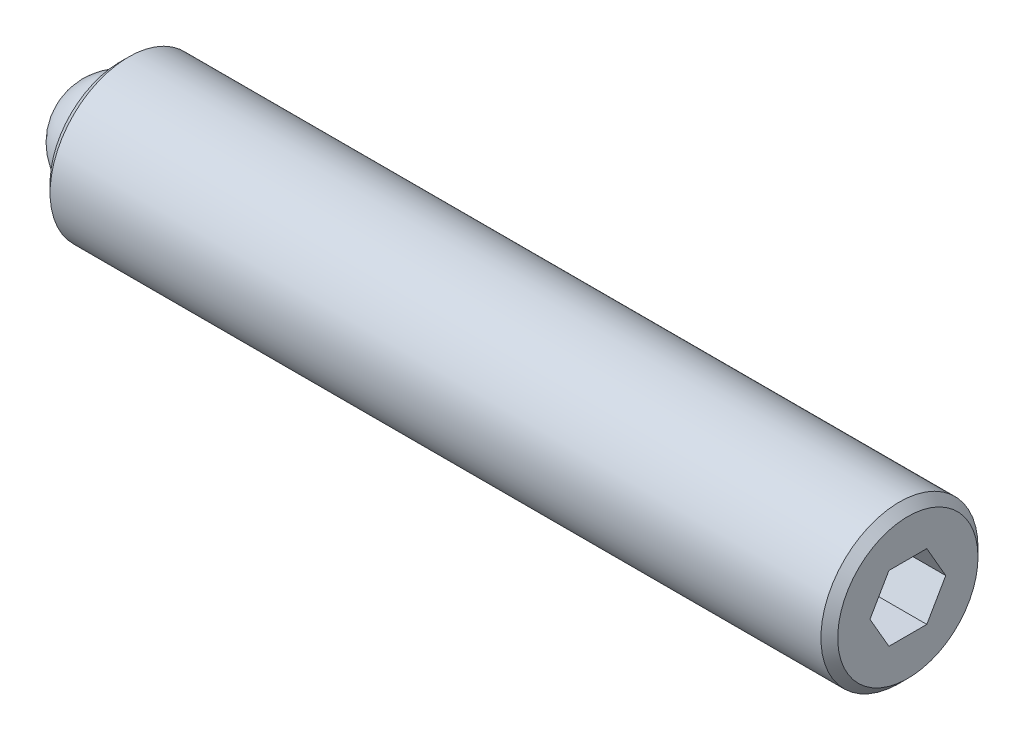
ISO-10303-21;
HEADER;
FILE_DESCRIPTION(('STEP AP214'),'2;1');
FILE_NAME('part.step','',(''),(''),'','','');
FILE_SCHEMA(('AUTOMOTIVE_DESIGN { 1 0 10303 214 1 1 1 1 }'));
ENDSEC;
DATA;
#1=APPLICATION_CONTEXT('core data for automotive mechanical design processes');
#2=APPLICATION_PROTOCOL_DEFINITION('international standard','automotive_design',2000,#1);
#3=PRODUCT_CONTEXT('',#1,'mechanical');
#4=PRODUCT('Part','Part','',(#3));
#5=PRODUCT_RELATED_PRODUCT_CATEGORY('part','',(#4));
#6=PRODUCT_DEFINITION_FORMATION('','',#4);
#7=PRODUCT_DEFINITION_CONTEXT('part definition',#1,'design');
#8=PRODUCT_DEFINITION('design','',#6,#7);
#9=PRODUCT_DEFINITION_SHAPE('','',#8);
#10=(LENGTH_UNIT() NAMED_UNIT(*) SI_UNIT(.MILLI.,.METRE.));
#11=(NAMED_UNIT(*) PLANE_ANGLE_UNIT() SI_UNIT($,.RADIAN.));
#12=(NAMED_UNIT(*) SI_UNIT($,.STERADIAN.) SOLID_ANGLE_UNIT());
#13=UNCERTAINTY_MEASURE_WITH_UNIT(LENGTH_MEASURE(1.E-05),#10,'distance_accuracy_value','');
#14=(GEOMETRIC_REPRESENTATION_CONTEXT(3) GLOBAL_UNCERTAINTY_ASSIGNED_CONTEXT((#13)) GLOBAL_UNIT_ASSIGNED_CONTEXT((#10,
#11,#12)) REPRESENTATION_CONTEXT('',''));
#15=CARTESIAN_POINT('',(0.,0.,0.));
#16=DIRECTION('',(0.,0.,1.));
#17=DIRECTION('',(1.,0.,0.));
#18=AXIS2_PLACEMENT_3D('',#15,#16,#17);
#19=CARTESIAN_POINT('',(0.,0.,0.));
#20=DIRECTION('',(0.,-1.,0.));
#21=DIRECTION('',(0.,0.,1.));
#22=AXIS2_PLACEMENT_3D('',#19,#20,#21);
#23=SPHERICAL_SURFACE('',#22,1.5875);
#24=CARTESIAN_POINT('',(0.,-1.5875,0.));
#25=VERTEX_POINT('',#24);
#26=VERTEX_LOOP('',#25);
#27=FACE_BOUND('',#26,.T.);
#28=ADVANCED_FACE('F43',(#27),#23,.T.);
#29=CLOSED_SHELL('',(#28));
#30=MANIFOLD_SOLID_BREP('B2',#29);
#31=CARTESIAN_POINT('',(23.8125,0.,0.));
#32=DIRECTION('',(-1.,0.,0.));
#33=DIRECTION('',(0.,0.,1.));
#34=AXIS2_PLACEMENT_3D('',#31,#32,#33);
#35=CYLINDRICAL_SURFACE('',#34,2.3749);
#36=CARTESIAN_POINT('',(23.5585,0.,0.));
#37=DIRECTION('',(1.,0.,0.));
#38=DIRECTION('',(0.,0.,-1.));
#39=AXIS2_PLACEMENT_3D('',#36,#37,#38);
#40=CIRCLE('',#39,2.3749);
#41=CARTESIAN_POINT('',(23.5585,0.,-2.3749));
#42=VERTEX_POINT('',#41);
#43=EDGE_CURVE('E41',#42,#42,#40,.F.);
#44=ORIENTED_EDGE('',*,*,#43,.T.);
#45=EDGE_LOOP('',(#44));
#46=FACE_BOUND('',#45,.T.);
#47=CARTESIAN_POINT('',(0.254000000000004,0.,0.));
#48=DIRECTION('',(1.,0.,0.));
#49=DIRECTION('',(0.,0.,-1.));
#50=AXIS2_PLACEMENT_3D('',#47,#48,#49);
#51=CIRCLE('',#50,2.3749);
#52=CARTESIAN_POINT('',(0.254000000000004,0.,-2.3749));
#53=VERTEX_POINT('',#52);
#54=EDGE_CURVE('E177',#53,#53,#51,.T.);
#55=ORIENTED_EDGE('',*,*,#54,.T.);
#56=EDGE_LOOP('',(#55));
#57=FACE_BOUND('',#56,.T.);
#58=ADVANCED_FACE('F56',(#46,#57),#35,.T.);
#59=CARTESIAN_POINT('',(23.8125,0.,0.));
#60=DIRECTION('',(1.,0.,0.));
#61=DIRECTION('',(0.,0.,-1.));
#62=AXIS2_PLACEMENT_3D('',#59,#60,#61);
#63=PLANE('',#62);
#64=DIRECTION('',(0.,0.866025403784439,-0.5));
#65=VECTOR('',#64,1.);
#66=CARTESIAN_POINT('',(23.8125,-0.992187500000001,-0.572839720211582));
#67=LINE('',#66,#65);
#68=CARTESIAN_POINT('',(23.8125,-0.992187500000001,-0.572839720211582));
#69=VERTEX_POINT('',#68);
#70=CARTESIAN_POINT('',(23.8125,0.,-1.14567944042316));
#71=VERTEX_POINT('',#70);
#72=EDGE_CURVE('E78',#69,#71,#67,.T.);
#73=ORIENTED_EDGE('',*,*,#72,.F.);
#74=DIRECTION('',(0.,0.,-1.));
#75=VECTOR('',#74,1.);
#76=CARTESIAN_POINT('',(23.8125,-0.992187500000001,0.572839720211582));
#77=LINE('',#76,#75);
#78=CARTESIAN_POINT('',(23.8125,-0.992187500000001,0.572839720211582));
#79=VERTEX_POINT('',#78);
#80=EDGE_CURVE('E146',#79,#69,#77,.T.);
#81=ORIENTED_EDGE('',*,*,#80,.F.);
#82=DIRECTION('',(0.,-0.866025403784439,-0.5));
#83=VECTOR('',#82,1.);
#84=CARTESIAN_POINT('',(23.8125,0.,1.14567944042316));
#85=LINE('',#84,#83);
#86=CARTESIAN_POINT('',(23.8125,0.,1.14567944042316));
#87=VERTEX_POINT('',#86);
#88=EDGE_CURVE('E170',#87,#79,#85,.T.);
#89=ORIENTED_EDGE('',*,*,#88,.F.);
#90=DIRECTION('',(0.,-0.866025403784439,0.5));
#91=VECTOR('',#90,1.);
#92=CARTESIAN_POINT('',(23.8125,0.992187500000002,0.572839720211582));
#93=LINE('',#92,#91);
#94=CARTESIAN_POINT('',(23.8125,0.992187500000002,0.572839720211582));
#95=VERTEX_POINT('',#94);
#96=EDGE_CURVE('E167',#95,#87,#93,.T.);
#97=ORIENTED_EDGE('',*,*,#96,.F.);
#98=DIRECTION('',(0.,0.,1.));
#99=VECTOR('',#98,1.);
#100=CARTESIAN_POINT('',(23.8125,0.992187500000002,-0.572839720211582));
#101=LINE('',#100,#99);
#102=CARTESIAN_POINT('',(23.8125,0.992187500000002,-0.572839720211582));
#103=VERTEX_POINT('',#102);
#104=EDGE_CURVE('E164',#103,#95,#101,.T.);
#105=ORIENTED_EDGE('',*,*,#104,.F.);
#106=DIRECTION('',(0.,0.866025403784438,0.5));
#107=VECTOR('',#106,1.);
#108=CARTESIAN_POINT('',(23.8125,0.,-1.14567944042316));
#109=LINE('',#108,#107);
#110=EDGE_CURVE('E137',#71,#103,#109,.T.);
#111=ORIENTED_EDGE('',*,*,#110,.F.);
#112=EDGE_LOOP('',(#73,#81,#89,#97,#105,#111));
#113=FACE_BOUND('',#112,.T.);
#114=CARTESIAN_POINT('',(23.8125,0.,0.));
#115=DIRECTION('',(1.,0.,0.));
#116=DIRECTION('',(0.,0.,-1.));
#117=AXIS2_PLACEMENT_3D('',#114,#115,#116);
#118=CIRCLE('',#117,2.1209);
#119=CARTESIAN_POINT('',(23.8125,0.,-2.1209));
#120=VERTEX_POINT('',#119);
#121=EDGE_CURVE('E64',#120,#120,#118,.T.);
#122=ORIENTED_EDGE('',*,*,#121,.T.);
#123=EDGE_LOOP('',(#122));
#124=FACE_BOUND('',#123,.T.);
#125=ADVANCED_FACE('F194',(#113,#124),#63,.T.);
#126=CARTESIAN_POINT('',(0.,0.,0.));
#127=DIRECTION('',(1.,0.,0.));
#128=DIRECTION('',(0.,0.,-1.));
#129=AXIS2_PLACEMENT_3D('',#126,#127,#128);
#130=PLANE('',#129);
#131=CARTESIAN_POINT('',(0.,0.,0.));
#132=DIRECTION('',(-1.,0.,0.));
#133=DIRECTION('',(0.,0.,1.));
#134=AXIS2_PLACEMENT_3D('',#131,#132,#133);
#135=CIRCLE('',#134,1.5875);
#136=CARTESIAN_POINT('',(0.,1.58623,-0.0634872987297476));
#137=VERTEX_POINT('',#136);
#138=CARTESIAN_POINT('',(0.,1.58623,0.0634872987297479));
#139=VERTEX_POINT('',#138);
#140=EDGE_CURVE('E133',#137,#139,#135,.T.);
#141=ORIENTED_EDGE('',*,*,#140,.F.);
#142=CARTESIAN_POINT('',(0.,1.5875,0.));
#143=DIRECTION('',(-1.,0.,0.));
#144=DIRECTION('',(0.,0.,1.));
#145=AXIS2_PLACEMENT_3D('',#142,#143,#144);
#146=CIRCLE('',#145,0.0635000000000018);
#147=EDGE_CURVE('E126',#139,#137,#146,.T.);
#148=ORIENTED_EDGE('',*,*,#147,.F.);
#149=EDGE_LOOP('',(#141,#148));
#150=FACE_BOUND('',#149,.T.);
#151=CARTESIAN_POINT('',(0.,0.,0.));
#152=DIRECTION('',(1.,0.,0.));
#153=DIRECTION('',(0.,0.,-1.));
#154=AXIS2_PLACEMENT_3D('',#151,#152,#153);
#155=CIRCLE('',#154,2.12089999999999);
#156=CARTESIAN_POINT('',(0.,0.,-2.12089999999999));
#157=VERTEX_POINT('',#156);
#158=EDGE_CURVE('E189',#157,#157,#155,.F.);
#159=ORIENTED_EDGE('',*,*,#158,.T.);
#160=EDGE_LOOP('',(#159));
#161=FACE_BOUND('',#160,.T.);
#162=ADVANCED_FACE('F206',(#150,#161),#130,.F.);
#163=CARTESIAN_POINT('',(0.254000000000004,0.,0.));
#164=DIRECTION('',(1.,0.,0.));
#165=DIRECTION('',(0.,0.,-1.));
#166=AXIS2_PLACEMENT_3D('',#163,#164,#165);
#167=CONICAL_SURFACE('',#166,2.3749,0.785398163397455);
#168=ORIENTED_EDGE('',*,*,#158,.F.);
#169=EDGE_LOOP('',(#168));
#170=FACE_BOUND('',#169,.T.);
#171=ORIENTED_EDGE('',*,*,#54,.F.);
#172=EDGE_LOOP('',(#171));
#173=FACE_BOUND('',#172,.T.);
#174=ADVANCED_FACE('F198',(#170,#173),#167,.T.);
#175=CARTESIAN_POINT('',(23.8125,0.,0.));
#176=DIRECTION('',(-1.,0.,0.));
#177=DIRECTION('',(0.,0.,1.));
#178=AXIS2_PLACEMENT_3D('',#175,#176,#177);
#179=CONICAL_SURFACE('',#178,2.1209,0.785398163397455);
#180=ORIENTED_EDGE('',*,*,#43,.F.);
#181=EDGE_LOOP('',(#180));
#182=FACE_BOUND('',#181,.T.);
#183=ORIENTED_EDGE('',*,*,#121,.F.);
#184=EDGE_LOOP('',(#183));
#185=FACE_BOUND('',#184,.T.);
#186=ADVANCED_FACE('F58',(#182,#185),#179,.T.);
#187=CARTESIAN_POINT('',(21.5265,-0.992187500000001,-0.572839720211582));
#188=DIRECTION('',(0.,-0.5,-0.866025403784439));
#189=DIRECTION('',(0.,0.866025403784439,-0.5));
#190=AXIS2_PLACEMENT_3D('',#187,#188,#189);
#191=PLANE('',#190);
#192=ORIENTED_EDGE('',*,*,#72,.T.);
#193=DIRECTION('',(1.,0.,0.));
#194=VECTOR('',#193,1.);
#195=CARTESIAN_POINT('',(21.5265,0.,-1.14567944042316));
#196=LINE('',#195,#194);
#197=CARTESIAN_POINT('',(21.5265,0.,-1.14567944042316));
#198=VERTEX_POINT('',#197);
#199=EDGE_CURVE('E160',#198,#71,#196,.T.);
#200=ORIENTED_EDGE('',*,*,#199,.F.);
#201=DIRECTION('',(0.,0.866025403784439,-0.5));
#202=VECTOR('',#201,1.);
#203=CARTESIAN_POINT('',(21.5265,-0.992187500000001,-0.572839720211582));
#204=LINE('',#203,#202);
#205=CARTESIAN_POINT('',(21.5265,-0.992187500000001,-0.572839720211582));
#206=VERTEX_POINT('',#205);
#207=EDGE_CURVE('E142',#206,#198,#204,.T.);
#208=ORIENTED_EDGE('',*,*,#207,.F.);
#209=DIRECTION('',(1.,0.,0.));
#210=VECTOR('',#209,1.);
#211=CARTESIAN_POINT('',(21.5265,-0.992187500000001,-0.572839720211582));
#212=LINE('',#211,#210);
#213=EDGE_CURVE('E175',#206,#69,#212,.T.);
#214=ORIENTED_EDGE('',*,*,#213,.T.);
#215=EDGE_LOOP('',(#192,#200,#208,#214));
#216=FACE_BOUND('',#215,.T.);
#217=ADVANCED_FACE('F197',(#216),#191,.F.);
#218=CARTESIAN_POINT('',(21.5265,-0.992187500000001,0.572839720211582));
#219=DIRECTION('',(0.,-1.,0.));
#220=DIRECTION('',(0.,0.,-1.));
#221=AXIS2_PLACEMENT_3D('',#218,#219,#220);
#222=PLANE('',#221);
#223=ORIENTED_EDGE('',*,*,#80,.T.);
#224=ORIENTED_EDGE('',*,*,#213,.F.);
#225=DIRECTION('',(0.,0.,-1.));
#226=VECTOR('',#225,1.);
#227=CARTESIAN_POINT('',(21.5265,-0.992187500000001,0.572839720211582));
#228=LINE('',#227,#226);
#229=CARTESIAN_POINT('',(21.5265,-0.992187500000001,0.572839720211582));
#230=VERTEX_POINT('',#229);
#231=EDGE_CURVE('E158',#230,#206,#228,.T.);
#232=ORIENTED_EDGE('',*,*,#231,.F.);
#233=DIRECTION('',(1.,0.,0.));
#234=VECTOR('',#233,1.);
#235=CARTESIAN_POINT('',(21.5265,-0.992187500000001,0.572839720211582));
#236=LINE('',#235,#234);
#237=EDGE_CURVE('E178',#230,#79,#236,.T.);
#238=ORIENTED_EDGE('',*,*,#237,.T.);
#239=EDGE_LOOP('',(#223,#224,#232,#238));
#240=FACE_BOUND('',#239,.T.);
#241=ADVANCED_FACE('F204',(#240),#222,.F.);
#242=CARTESIAN_POINT('',(21.5265,0.,1.14567944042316));
#243=DIRECTION('',(0.,-0.5,0.866025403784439));
#244=DIRECTION('',(0.,-0.866025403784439,-0.5));
#245=AXIS2_PLACEMENT_3D('',#242,#243,#244);
#246=PLANE('',#245);
#247=ORIENTED_EDGE('',*,*,#88,.T.);
#248=ORIENTED_EDGE('',*,*,#237,.F.);
#249=DIRECTION('',(0.,-0.866025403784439,-0.5));
#250=VECTOR('',#249,1.);
#251=CARTESIAN_POINT('',(21.5265,0.,1.14567944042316));
#252=LINE('',#251,#250);
#253=CARTESIAN_POINT('',(21.5265,0.,1.14567944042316));
#254=VERTEX_POINT('',#253);
#255=EDGE_CURVE('E155',#254,#230,#252,.T.);
#256=ORIENTED_EDGE('',*,*,#255,.F.);
#257=DIRECTION('',(1.,0.,0.));
#258=VECTOR('',#257,1.);
#259=CARTESIAN_POINT('',(21.5265,0.,1.14567944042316));
#260=LINE('',#259,#258);
#261=EDGE_CURVE('E180',#254,#87,#260,.T.);
#262=ORIENTED_EDGE('',*,*,#261,.T.);
#263=EDGE_LOOP('',(#247,#248,#256,#262));
#264=FACE_BOUND('',#263,.T.);
#265=ADVANCED_FACE('F234',(#264),#246,.F.);
#266=CARTESIAN_POINT('',(21.5265,0.992187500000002,0.572839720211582));
#267=DIRECTION('',(0.,0.5,0.866025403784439));
#268=DIRECTION('',(0.,-0.866025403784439,0.5));
#269=AXIS2_PLACEMENT_3D('',#266,#267,#268);
#270=PLANE('',#269);
#271=ORIENTED_EDGE('',*,*,#96,.T.);
#272=ORIENTED_EDGE('',*,*,#261,.F.);
#273=DIRECTION('',(0.,-0.866025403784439,0.5));
#274=VECTOR('',#273,1.);
#275=CARTESIAN_POINT('',(21.5265,0.992187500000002,0.572839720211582));
#276=LINE('',#275,#274);
#277=CARTESIAN_POINT('',(21.5265,0.992187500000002,0.572839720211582));
#278=VERTEX_POINT('',#277);
#279=EDGE_CURVE('E152',#278,#254,#276,.T.);
#280=ORIENTED_EDGE('',*,*,#279,.F.);
#281=DIRECTION('',(1.,0.,0.));
#282=VECTOR('',#281,1.);
#283=CARTESIAN_POINT('',(21.5265,0.992187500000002,0.572839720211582));
#284=LINE('',#283,#282);
#285=EDGE_CURVE('E182',#278,#95,#284,.T.);
#286=ORIENTED_EDGE('',*,*,#285,.T.);
#287=EDGE_LOOP('',(#271,#272,#280,#286));
#288=FACE_BOUND('',#287,.T.);
#289=ADVANCED_FACE('F230',(#288),#270,.F.);
#290=CARTESIAN_POINT('',(21.5265,0.992187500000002,-0.572839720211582));
#291=DIRECTION('',(0.,1.,0.));
#292=DIRECTION('',(0.,0.,1.));
#293=AXIS2_PLACEMENT_3D('',#290,#291,#292);
#294=PLANE('',#293);
#295=ORIENTED_EDGE('',*,*,#104,.T.);
#296=ORIENTED_EDGE('',*,*,#285,.F.);
#297=DIRECTION('',(0.,0.,1.));
#298=VECTOR('',#297,1.);
#299=CARTESIAN_POINT('',(21.5265,0.992187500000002,-0.572839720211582));
#300=LINE('',#299,#298);
#301=CARTESIAN_POINT('',(21.5265,0.992187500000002,-0.572839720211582));
#302=VERTEX_POINT('',#301);
#303=EDGE_CURVE('E149',#302,#278,#300,.T.);
#304=ORIENTED_EDGE('',*,*,#303,.F.);
#305=DIRECTION('',(1.,0.,0.));
#306=VECTOR('',#305,1.);
#307=CARTESIAN_POINT('',(21.5265,0.992187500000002,-0.572839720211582));
#308=LINE('',#307,#306);
#309=EDGE_CURVE('E184',#302,#103,#308,.T.);
#310=ORIENTED_EDGE('',*,*,#309,.T.);
#311=EDGE_LOOP('',(#295,#296,#304,#310));
#312=FACE_BOUND('',#311,.T.);
#313=ADVANCED_FACE('F226',(#312),#294,.F.);
#314=CARTESIAN_POINT('',(21.5265,0.,-1.14567944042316));
#315=DIRECTION('',(0.,0.5,-0.866025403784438));
#316=DIRECTION('',(0.,0.866025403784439,0.5));
#317=AXIS2_PLACEMENT_3D('',#314,#315,#316);
#318=PLANE('',#317);
#319=ORIENTED_EDGE('',*,*,#110,.T.);
#320=ORIENTED_EDGE('',*,*,#309,.F.);
#321=DIRECTION('',(0.,0.866025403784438,0.5));
#322=VECTOR('',#321,1.);
#323=CARTESIAN_POINT('',(21.5265,0.,-1.14567944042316));
#324=LINE('',#323,#322);
#325=EDGE_CURVE('E145',#198,#302,#324,.T.);
#326=ORIENTED_EDGE('',*,*,#325,.F.);
#327=ORIENTED_EDGE('',*,*,#199,.T.);
#328=EDGE_LOOP('',(#319,#320,#326,#327));
#329=FACE_BOUND('',#328,.T.);
#330=ADVANCED_FACE('F222',(#329),#318,.F.);
#331=CARTESIAN_POINT('',(21.5265,0.,0.));
#332=DIRECTION('',(1.,0.,0.));
#333=DIRECTION('',(0.,0.,-1.));
#334=AXIS2_PLACEMENT_3D('',#331,#332,#333);
#335=PLANE('',#334);
#336=ORIENTED_EDGE('',*,*,#207,.T.);
#337=ORIENTED_EDGE('',*,*,#325,.T.);
#338=ORIENTED_EDGE('',*,*,#303,.T.);
#339=ORIENTED_EDGE('',*,*,#279,.T.);
#340=ORIENTED_EDGE('',*,*,#255,.T.);
#341=ORIENTED_EDGE('',*,*,#231,.T.);
#342=EDGE_LOOP('',(#336,#337,#338,#339,#340,#341));
#343=FACE_BOUND('',#342,.T.);
#344=ADVANCED_FACE('F225',(#343),#335,.T.);
#345=CARTESIAN_POINT('',(1.5875,0.,0.));
#346=DIRECTION('',(-1.,0.,0.));
#347=DIRECTION('',(0.,0.,1.));
#348=AXIS2_PLACEMENT_3D('',#345,#346,#347);
#349=CYLINDRICAL_SURFACE('',#348,1.5875);
#350=CARTESIAN_POINT('',(1.5875,0.,0.));
#351=DIRECTION('',(-1.,0.,0.));
#352=DIRECTION('',(0.,0.,1.));
#353=AXIS2_PLACEMENT_3D('',#350,#351,#352);
#354=CIRCLE('',#353,1.5875);
#355=CARTESIAN_POINT('',(1.5875,1.58623,-0.0634872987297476));
#356=VERTEX_POINT('',#355);
#357=CARTESIAN_POINT('',(1.5875,1.58623,0.0634872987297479));
#358=VERTEX_POINT('',#357);
#359=EDGE_CURVE('E131',#356,#358,#354,.T.);
#360=ORIENTED_EDGE('',*,*,#359,.F.);
#361=DIRECTION('',(-1.,0.,0.));
#362=VECTOR('',#361,1.);
#363=CARTESIAN_POINT('',(1.5875,1.58623,-0.0634872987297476));
#364=LINE('',#363,#362);
#365=EDGE_CURVE('E124',#356,#137,#364,.T.);
#366=ORIENTED_EDGE('',*,*,#365,.T.);
#367=ORIENTED_EDGE('',*,*,#140,.T.);
#368=DIRECTION('',(-1.,0.,0.));
#369=VECTOR('',#368,1.);
#370=CARTESIAN_POINT('',(1.5875,1.58623,0.0634872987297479));
#371=LINE('',#370,#369);
#372=EDGE_CURVE('E121',#358,#139,#371,.T.);
#373=ORIENTED_EDGE('',*,*,#372,.F.);
#374=EDGE_LOOP('',(#360,#366,#367,#373));
#375=FACE_BOUND('',#374,.T.);
#376=ADVANCED_FACE('F130',(#375),#349,.F.);
#377=CARTESIAN_POINT('',(1.5875,0.,0.));
#378=DIRECTION('',(-1.,0.,0.));
#379=DIRECTION('',(0.,0.,1.));
#380=AXIS2_PLACEMENT_3D('',#377,#378,#379);
#381=PLANE('',#380);
#382=ORIENTED_EDGE('',*,*,#359,.T.);
#383=CARTESIAN_POINT('',(1.5875,1.5875,0.));
#384=DIRECTION('',(-1.,0.,0.));
#385=DIRECTION('',(0.,0.,1.));
#386=AXIS2_PLACEMENT_3D('',#383,#384,#385);
#387=CIRCLE('',#386,0.0635000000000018);
#388=EDGE_CURVE('E70',#358,#356,#387,.T.);
#389=ORIENTED_EDGE('',*,*,#388,.T.);
#390=EDGE_LOOP('',(#382,#389));
#391=FACE_BOUND('',#390,.T.);
#392=ADVANCED_FACE('F135',(#391),#381,.T.);
#393=CARTESIAN_POINT('',(1.5875,1.5875,0.));
#394=DIRECTION('',(-1.,0.,0.));
#395=DIRECTION('',(0.,0.,1.));
#396=AXIS2_PLACEMENT_3D('',#393,#394,#395);
#397=CYLINDRICAL_SURFACE('',#396,0.0635000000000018);
#398=ORIENTED_EDGE('',*,*,#147,.T.);
#399=ORIENTED_EDGE('',*,*,#365,.F.);
#400=ORIENTED_EDGE('',*,*,#388,.F.);
#401=ORIENTED_EDGE('',*,*,#372,.T.);
#402=EDGE_LOOP('',(#398,#399,#400,#401));
#403=FACE_BOUND('',#402,.T.);
#404=ADVANCED_FACE('F120',(#403),#397,.F.);
#405=CLOSED_SHELL('',(#58,#125,#162,#174,#186,#217,#241,#265,#289,#313,#330,#344,#376,#392,#404));
#406=MANIFOLD_SOLID_BREP('B6',#405);
#407=ADVANCED_BREP_SHAPE_REPRESENTATION('',(#18,#30,#406),#14);
#408=SHAPE_DEFINITION_REPRESENTATION(#9,#407);
ENDSEC;
END-ISO-10303-21;
